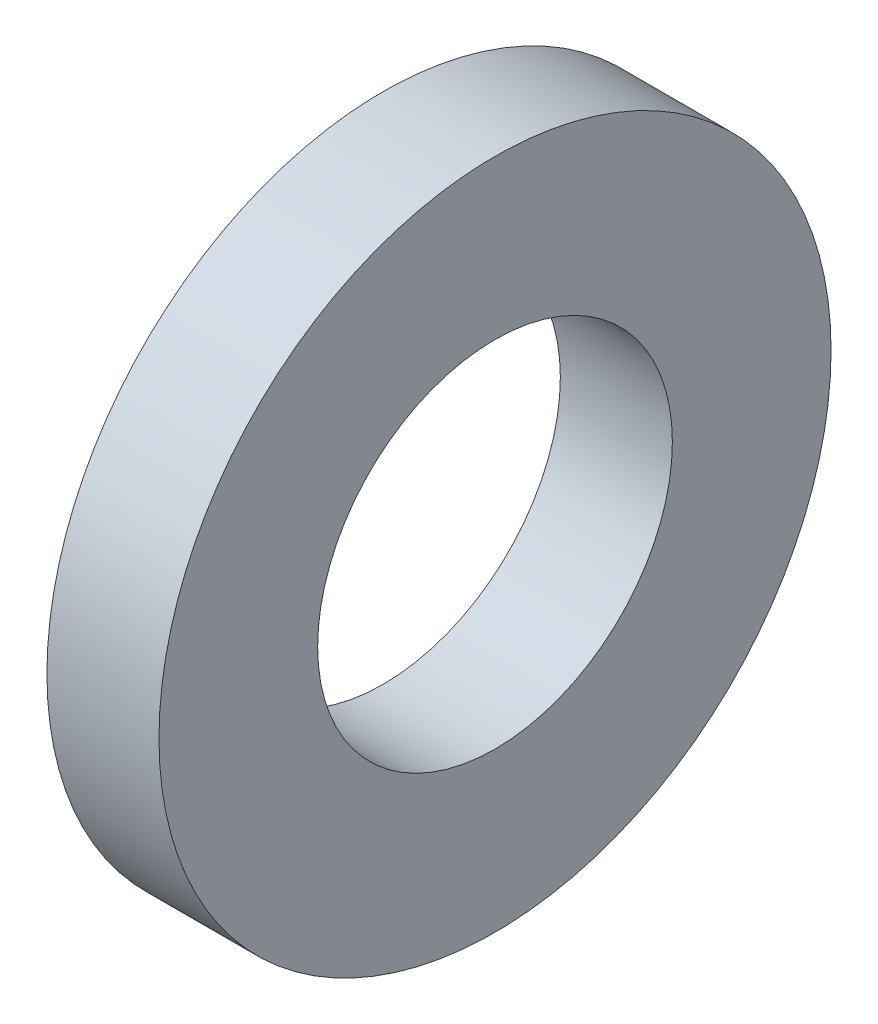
ISO-10303-21;
HEADER;
FILE_DESCRIPTION(('STEP AP214'),'2;1');
FILE_NAME('part.step','',(''),(''),'','','');
FILE_SCHEMA(('AUTOMOTIVE_DESIGN { 1 0 10303 214 1 1 1 1 }'));
ENDSEC;
DATA;
#1=APPLICATION_CONTEXT('core data for automotive mechanical design processes');
#2=APPLICATION_PROTOCOL_DEFINITION('international standard','automotive_design',2000,#1);
#3=PRODUCT_CONTEXT('',#1,'mechanical');
#4=PRODUCT('Part','Part','',(#3));
#5=PRODUCT_RELATED_PRODUCT_CATEGORY('part','',(#4));
#6=PRODUCT_DEFINITION_FORMATION('','',#4);
#7=PRODUCT_DEFINITION_CONTEXT('part definition',#1,'design');
#8=PRODUCT_DEFINITION('design','',#6,#7);
#9=PRODUCT_DEFINITION_SHAPE('','',#8);
#10=(LENGTH_UNIT() NAMED_UNIT(*) SI_UNIT(.MILLI.,.METRE.));
#11=(NAMED_UNIT(*) PLANE_ANGLE_UNIT() SI_UNIT($,.RADIAN.));
#12=(NAMED_UNIT(*) SI_UNIT($,.STERADIAN.) SOLID_ANGLE_UNIT());
#13=UNCERTAINTY_MEASURE_WITH_UNIT(LENGTH_MEASURE(1.E-05),#10,'distance_accuracy_value','');
#14=(GEOMETRIC_REPRESENTATION_CONTEXT(3) GLOBAL_UNCERTAINTY_ASSIGNED_CONTEXT((#13)) GLOBAL_UNIT_ASSIGNED_CONTEXT((#10,
#11,#12)) REPRESENTATION_CONTEXT('',''));
#15=CARTESIAN_POINT('',(0.,0.,0.));
#16=DIRECTION('',(0.,0.,1.));
#17=DIRECTION('',(1.,0.,0.));
#18=AXIS2_PLACEMENT_3D('',#15,#16,#17);
#19=CARTESIAN_POINT('',(0.,120.65,0.));
#20=DIRECTION('',(1.,0.,0.));
#21=DIRECTION('',(0.,0.,-1.));
#22=AXIS2_PLACEMENT_3D('',#19,#20,#21);
#23=PLANE('',#22);
#24=CARTESIAN_POINT('',(0.,146.665875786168,-60.7509948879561));
#25=DIRECTION('',(-1.,0.,0.));
#26=DIRECTION('',(0.,0.707106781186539,0.707106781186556));
#27=AXIS2_PLACEMENT_3D('',#24,#25,#26);
#28=CIRCLE('',#27,12.7);
#29=CARTESIAN_POINT('',(0.,155.646131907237,-51.7707387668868));
#30=VERTEX_POINT('',#29);
#31=EDGE_CURVE('E88',#30,#30,#28,.T.);
#32=ORIENTED_EDGE('',*,*,#31,.F.);
#33=EDGE_LOOP('',(#32));
#34=FACE_BOUND('',#33,.T.);
#35=CARTESIAN_POINT('',(0.,60.7509948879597,-146.665875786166));
#36=DIRECTION('',(-1.,0.,0.));
#37=DIRECTION('',(0.,1.,0.));
#38=AXIS2_PLACEMENT_3D('',#35,#36,#37);
#39=CIRCLE('',#38,12.7);
#40=CARTESIAN_POINT('',(0.,73.4509948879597,-146.665875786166));
#41=VERTEX_POINT('',#40);
#42=EDGE_CURVE('E82',#41,#41,#39,.T.);
#43=ORIENTED_EDGE('',*,*,#42,.F.);
#44=EDGE_LOOP('',(#43));
#45=FACE_BOUND('',#44,.T.);
#46=CARTESIAN_POINT('',(0.,-60.7509948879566,-146.665875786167));
#47=DIRECTION('',(-1.,0.,0.));
#48=DIRECTION('',(0.,0.707106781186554,-0.707106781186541));
#49=AXIS2_PLACEMENT_3D('',#46,#47,#48);
#50=CIRCLE('',#49,12.7);
#51=CARTESIAN_POINT('',(0.,-51.7707387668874,-155.646131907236));
#52=VERTEX_POINT('',#51);
#53=EDGE_CURVE('E76',#52,#52,#50,.T.);
#54=ORIENTED_EDGE('',*,*,#53,.F.);
#55=EDGE_LOOP('',(#54));
#56=FACE_BOUND('',#55,.T.);
#57=CARTESIAN_POINT('',(0.,-146.665875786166,-60.7509948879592));
#58=DIRECTION('',(-1.,0.,0.));
#59=DIRECTION('',(0.,0.,-1.));
#60=AXIS2_PLACEMENT_3D('',#57,#58,#59);
#61=CIRCLE('',#60,12.7);
#62=CARTESIAN_POINT('',(0.,-146.665875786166,-73.4509948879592));
#63=VERTEX_POINT('',#62);
#64=EDGE_CURVE('E70',#63,#63,#61,.T.);
#65=ORIENTED_EDGE('',*,*,#64,.F.);
#66=EDGE_LOOP('',(#65));
#67=FACE_BOUND('',#66,.T.);
#68=CARTESIAN_POINT('',(0.,-146.665875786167,60.7509948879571));
#69=DIRECTION('',(-1.,0.,0.));
#70=DIRECTION('',(0.,-0.707106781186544,-0.707106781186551));
#71=AXIS2_PLACEMENT_3D('',#68,#69,#70);
#72=CIRCLE('',#71,12.7);
#73=CARTESIAN_POINT('',(0.,-155.646131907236,51.7707387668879));
#74=VERTEX_POINT('',#73);
#75=EDGE_CURVE('E64',#74,#74,#72,.T.);
#76=ORIENTED_EDGE('',*,*,#75,.F.);
#77=EDGE_LOOP('',(#76));
#78=FACE_BOUND('',#77,.T.);
#79=CARTESIAN_POINT('',(0.,-60.7509948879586,146.665875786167));
#80=DIRECTION('',(-1.,0.,0.));
#81=DIRECTION('',(0.,-1.,0.));
#82=AXIS2_PLACEMENT_3D('',#79,#80,#81);
#83=CIRCLE('',#82,12.7);
#84=CARTESIAN_POINT('',(0.,-73.4509948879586,146.665875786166));
#85=VERTEX_POINT('',#84);
#86=EDGE_CURVE('E58',#85,#85,#83,.T.);
#87=ORIENTED_EDGE('',*,*,#86,.F.);
#88=EDGE_LOOP('',(#87));
#89=FACE_BOUND('',#88,.T.);
#90=CARTESIAN_POINT('',(0.,60.7509948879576,146.665875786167));
#91=DIRECTION('',(-1.,0.,0.));
#92=DIRECTION('',(0.,-0.707106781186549,0.707106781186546));
#93=AXIS2_PLACEMENT_3D('',#90,#91,#92);
#94=CIRCLE('',#93,12.7);
#95=CARTESIAN_POINT('',(0.,51.7707387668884,155.646131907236));
#96=VERTEX_POINT('',#95);
#97=EDGE_CURVE('E52',#96,#96,#94,.T.);
#98=ORIENTED_EDGE('',*,*,#97,.F.);
#99=EDGE_LOOP('',(#98));
#100=FACE_BOUND('',#99,.T.);
#101=CARTESIAN_POINT('',(0.,146.665875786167,60.7509948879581));
#102=DIRECTION('',(-1.,0.,0.));
#103=DIRECTION('',(0.,0.,1.));
#104=AXIS2_PLACEMENT_3D('',#101,#102,#103);
#105=CIRCLE('',#104,12.7);
#106=CARTESIAN_POINT('',(0.,146.665875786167,73.4509948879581));
#107=VERTEX_POINT('',#106);
#108=EDGE_CURVE('E46',#107,#107,#105,.T.);
#109=ORIENTED_EDGE('',*,*,#108,.F.);
#110=EDGE_LOOP('',(#109));
#111=FACE_BOUND('',#110,.T.);
#112=CARTESIAN_POINT('',(0.,0.,0.));
#113=DIRECTION('',(-1.,0.,0.));
#114=DIRECTION('',(0.,0.,1.));
#115=AXIS2_PLACEMENT_3D('',#112,#113,#114);
#116=CIRCLE('',#115,120.65);
#117=CARTESIAN_POINT('',(0.,0.,120.65));
#118=VERTEX_POINT('',#117);
#119=EDGE_CURVE('E38',#118,#118,#116,.T.);
#120=ORIENTED_EDGE('',*,*,#119,.F.);
#121=EDGE_LOOP('',(#120));
#122=FACE_BOUND('',#121,.T.);
#123=CARTESIAN_POINT('',(0.,0.,0.));
#124=DIRECTION('',(-1.,0.,0.));
#125=DIRECTION('',(0.,0.,1.));
#126=AXIS2_PLACEMENT_3D('',#123,#124,#125);
#127=CIRCLE('',#126,228.6);
#128=CARTESIAN_POINT('',(0.,0.,228.6));
#129=VERTEX_POINT('',#128);
#130=EDGE_CURVE('E10',#129,#129,#127,.T.);
#131=ORIENTED_EDGE('',*,*,#130,.T.);
#132=EDGE_LOOP('',(#131));
#133=FACE_BOUND('',#132,.T.);
#134=ADVANCED_FACE('F24',(#34,#45,#56,#67,#78,#89,#100,#111,#122,#133),#23,.F.);
#135=CARTESIAN_POINT('',(0.,0.,0.));
#136=DIRECTION('',(-1.,0.,0.));
#137=DIRECTION('',(0.,0.,1.));
#138=AXIS2_PLACEMENT_3D('',#135,#136,#137);
#139=CYLINDRICAL_SURFACE('',#138,228.6);
#140=ORIENTED_EDGE('',*,*,#130,.F.);
#141=EDGE_LOOP('',(#140));
#142=FACE_BOUND('',#141,.T.);
#143=CARTESIAN_POINT('',(76.2,0.,0.));
#144=DIRECTION('',(-1.,0.,0.));
#145=DIRECTION('',(0.,0.,1.));
#146=AXIS2_PLACEMENT_3D('',#143,#144,#145);
#147=CIRCLE('',#146,228.6);
#148=CARTESIAN_POINT('',(76.2,0.,228.6));
#149=VERTEX_POINT('',#148);
#150=EDGE_CURVE('E30',#149,#149,#147,.T.);
#151=ORIENTED_EDGE('',*,*,#150,.T.);
#152=EDGE_LOOP('',(#151));
#153=FACE_BOUND('',#152,.T.);
#154=ADVANCED_FACE('F96',(#142,#153),#139,.T.);
#155=CARTESIAN_POINT('',(76.2,228.6,0.));
#156=DIRECTION('',(-1.,0.,0.));
#157=DIRECTION('',(0.,0.,1.));
#158=AXIS2_PLACEMENT_3D('',#155,#156,#157);
#159=PLANE('',#158);
#160=ORIENTED_EDGE('',*,*,#150,.F.);
#161=EDGE_LOOP('',(#160));
#162=FACE_BOUND('',#161,.T.);
#163=CARTESIAN_POINT('',(76.2,0.,0.));
#164=DIRECTION('',(-1.,0.,0.));
#165=DIRECTION('',(0.,0.,1.));
#166=AXIS2_PLACEMENT_3D('',#163,#164,#165);
#167=CIRCLE('',#166,120.65);
#168=CARTESIAN_POINT('',(76.2,0.,120.65));
#169=VERTEX_POINT('',#168);
#170=EDGE_CURVE('E34',#169,#169,#167,.T.);
#171=ORIENTED_EDGE('',*,*,#170,.T.);
#172=EDGE_LOOP('',(#171));
#173=FACE_BOUND('',#172,.T.);
#174=ADVANCED_FACE('F116',(#162,#173),#159,.F.);
#175=CARTESIAN_POINT('',(0.,0.,0.));
#176=DIRECTION('',(-1.,0.,0.));
#177=DIRECTION('',(0.,0.,1.));
#178=AXIS2_PLACEMENT_3D('',#175,#176,#177);
#179=CYLINDRICAL_SURFACE('',#178,120.65);
#180=ORIENTED_EDGE('',*,*,#170,.F.);
#181=EDGE_LOOP('',(#180));
#182=FACE_BOUND('',#181,.T.);
#183=ORIENTED_EDGE('',*,*,#119,.T.);
#184=EDGE_LOOP('',(#183));
#185=FACE_BOUND('',#184,.T.);
#186=ADVANCED_FACE('F113',(#182,#185),#179,.F.);
#187=CARTESIAN_POINT('',(30.,146.665875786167,60.7509948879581));
#188=DIRECTION('',(-1.,0.,0.));
#189=DIRECTION('',(0.,0.,1.));
#190=AXIS2_PLACEMENT_3D('',#187,#188,#189);
#191=CYLINDRICAL_SURFACE('',#190,12.7);
#192=CARTESIAN_POINT('',(30.,146.665875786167,60.7509948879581));
#193=DIRECTION('',(-1.,0.,0.));
#194=DIRECTION('',(0.,0.,1.));
#195=AXIS2_PLACEMENT_3D('',#192,#193,#194);
#196=CIRCLE('',#195,12.7);
#197=CARTESIAN_POINT('',(30.,146.665875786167,73.4509948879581));
#198=VERTEX_POINT('',#197);
#199=EDGE_CURVE('E43',#198,#198,#196,.T.);
#200=ORIENTED_EDGE('',*,*,#199,.F.);
#201=EDGE_LOOP('',(#200));
#202=FACE_BOUND('',#201,.T.);
#203=ORIENTED_EDGE('',*,*,#108,.T.);
#204=EDGE_LOOP('',(#203));
#205=FACE_BOUND('',#204,.T.);
#206=ADVANCED_FACE('F115',(#202,#205),#191,.F.);
#207=CARTESIAN_POINT('',(30.,146.665875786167,60.7509948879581));
#208=DIRECTION('',(-1.,0.,0.));
#209=DIRECTION('',(0.,0.,1.));
#210=AXIS2_PLACEMENT_3D('',#207,#208,#209);
#211=PLANE('',#210);
#212=ORIENTED_EDGE('',*,*,#199,.T.);
#213=EDGE_LOOP('',(#212));
#214=FACE_BOUND('',#213,.T.);
#215=ADVANCED_FACE('F123',(#214),#211,.T.);
#216=CARTESIAN_POINT('',(30.,60.7509948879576,146.665875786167));
#217=DIRECTION('',(-1.,0.,0.));
#218=DIRECTION('',(0.,0.,1.));
#219=AXIS2_PLACEMENT_3D('',#216,#217,#218);
#220=CYLINDRICAL_SURFACE('',#219,12.7);
#221=CARTESIAN_POINT('',(30.,60.7509948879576,146.665875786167));
#222=DIRECTION('',(-1.,0.,0.));
#223=DIRECTION('',(0.,-0.707106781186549,0.707106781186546));
#224=AXIS2_PLACEMENT_3D('',#221,#222,#223);
#225=CIRCLE('',#224,12.7);
#226=CARTESIAN_POINT('',(30.,51.7707387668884,155.646131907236));
#227=VERTEX_POINT('',#226);
#228=EDGE_CURVE('E49',#227,#227,#225,.T.);
#229=ORIENTED_EDGE('',*,*,#228,.F.);
#230=EDGE_LOOP('',(#229));
#231=FACE_BOUND('',#230,.T.);
#232=ORIENTED_EDGE('',*,*,#97,.T.);
#233=EDGE_LOOP('',(#232));
#234=FACE_BOUND('',#233,.T.);
#235=ADVANCED_FACE('F152',(#231,#234),#220,.F.);
#236=CARTESIAN_POINT('',(30.,60.7509948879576,146.665875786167));
#237=DIRECTION('',(-1.,0.,0.));
#238=DIRECTION('',(0.,-0.707106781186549,0.707106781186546));
#239=AXIS2_PLACEMENT_3D('',#236,#237,#238);
#240=PLANE('',#239);
#241=ORIENTED_EDGE('',*,*,#228,.T.);
#242=EDGE_LOOP('',(#241));
#243=FACE_BOUND('',#242,.T.);
#244=ADVANCED_FACE('F159',(#243),#240,.T.);
#245=CARTESIAN_POINT('',(30.,-60.7509948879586,146.665875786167));
#246=DIRECTION('',(-1.,0.,0.));
#247=DIRECTION('',(0.,0.,1.));
#248=AXIS2_PLACEMENT_3D('',#245,#246,#247);
#249=CYLINDRICAL_SURFACE('',#248,12.7);
#250=CARTESIAN_POINT('',(30.,-60.7509948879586,146.665875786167));
#251=DIRECTION('',(-1.,0.,0.));
#252=DIRECTION('',(0.,-1.,0.));
#253=AXIS2_PLACEMENT_3D('',#250,#251,#252);
#254=CIRCLE('',#253,12.7);
#255=CARTESIAN_POINT('',(30.,-73.4509948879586,146.665875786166));
#256=VERTEX_POINT('',#255);
#257=EDGE_CURVE('E55',#256,#256,#254,.T.);
#258=ORIENTED_EDGE('',*,*,#257,.F.);
#259=EDGE_LOOP('',(#258));
#260=FACE_BOUND('',#259,.T.);
#261=ORIENTED_EDGE('',*,*,#86,.T.);
#262=EDGE_LOOP('',(#261));
#263=FACE_BOUND('',#262,.T.);
#264=ADVANCED_FACE('F167',(#260,#263),#249,.F.);
#265=CARTESIAN_POINT('',(30.,-60.7509948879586,146.665875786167));
#266=DIRECTION('',(-1.,0.,0.));
#267=DIRECTION('',(0.,-1.,0.));
#268=AXIS2_PLACEMENT_3D('',#265,#266,#267);
#269=PLANE('',#268);
#270=ORIENTED_EDGE('',*,*,#257,.T.);
#271=EDGE_LOOP('',(#270));
#272=FACE_BOUND('',#271,.T.);
#273=ADVANCED_FACE('F175',(#272),#269,.T.);
#274=CARTESIAN_POINT('',(30.,-146.665875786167,60.7509948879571));
#275=DIRECTION('',(-1.,0.,0.));
#276=DIRECTION('',(0.,0.,1.));
#277=AXIS2_PLACEMENT_3D('',#274,#275,#276);
#278=CYLINDRICAL_SURFACE('',#277,12.7);
#279=CARTESIAN_POINT('',(30.,-146.665875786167,60.7509948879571));
#280=DIRECTION('',(-1.,0.,0.));
#281=DIRECTION('',(0.,-0.707106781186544,-0.707106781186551));
#282=AXIS2_PLACEMENT_3D('',#279,#280,#281);
#283=CIRCLE('',#282,12.7);
#284=CARTESIAN_POINT('',(30.,-155.646131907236,51.7707387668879));
#285=VERTEX_POINT('',#284);
#286=EDGE_CURVE('E61',#285,#285,#283,.T.);
#287=ORIENTED_EDGE('',*,*,#286,.F.);
#288=EDGE_LOOP('',(#287));
#289=FACE_BOUND('',#288,.T.);
#290=ORIENTED_EDGE('',*,*,#75,.T.);
#291=EDGE_LOOP('',(#290));
#292=FACE_BOUND('',#291,.T.);
#293=ADVANCED_FACE('F183',(#289,#292),#278,.F.);
#294=CARTESIAN_POINT('',(30.,-146.665875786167,60.7509948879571));
#295=DIRECTION('',(-1.,0.,0.));
#296=DIRECTION('',(0.,-0.707106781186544,-0.707106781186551));
#297=AXIS2_PLACEMENT_3D('',#294,#295,#296);
#298=PLANE('',#297);
#299=ORIENTED_EDGE('',*,*,#286,.T.);
#300=EDGE_LOOP('',(#299));
#301=FACE_BOUND('',#300,.T.);
#302=ADVANCED_FACE('F191',(#301),#298,.T.);
#303=CARTESIAN_POINT('',(30.,-146.665875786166,-60.7509948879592));
#304=DIRECTION('',(-1.,0.,0.));
#305=DIRECTION('',(0.,0.,1.));
#306=AXIS2_PLACEMENT_3D('',#303,#304,#305);
#307=CYLINDRICAL_SURFACE('',#306,12.7);
#308=CARTESIAN_POINT('',(30.,-146.665875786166,-60.7509948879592));
#309=DIRECTION('',(-1.,0.,0.));
#310=DIRECTION('',(0.,0.,-1.));
#311=AXIS2_PLACEMENT_3D('',#308,#309,#310);
#312=CIRCLE('',#311,12.7);
#313=CARTESIAN_POINT('',(30.,-146.665875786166,-73.4509948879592));
#314=VERTEX_POINT('',#313);
#315=EDGE_CURVE('E67',#314,#314,#312,.T.);
#316=ORIENTED_EDGE('',*,*,#315,.F.);
#317=EDGE_LOOP('',(#316));
#318=FACE_BOUND('',#317,.T.);
#319=ORIENTED_EDGE('',*,*,#64,.T.);
#320=EDGE_LOOP('',(#319));
#321=FACE_BOUND('',#320,.T.);
#322=ADVANCED_FACE('F199',(#318,#321),#307,.F.);
#323=CARTESIAN_POINT('',(30.,-146.665875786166,-60.7509948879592));
#324=DIRECTION('',(-1.,0.,0.));
#325=DIRECTION('',(0.,0.,-1.));
#326=AXIS2_PLACEMENT_3D('',#323,#324,#325);
#327=PLANE('',#326);
#328=ORIENTED_EDGE('',*,*,#315,.T.);
#329=EDGE_LOOP('',(#328));
#330=FACE_BOUND('',#329,.T.);
#331=ADVANCED_FACE('F207',(#330),#327,.T.);
#332=CARTESIAN_POINT('',(30.,-60.7509948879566,-146.665875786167));
#333=DIRECTION('',(-1.,0.,0.));
#334=DIRECTION('',(0.,0.,1.));
#335=AXIS2_PLACEMENT_3D('',#332,#333,#334);
#336=CYLINDRICAL_SURFACE('',#335,12.7);
#337=CARTESIAN_POINT('',(30.,-60.7509948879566,-146.665875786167));
#338=DIRECTION('',(-1.,0.,0.));
#339=DIRECTION('',(0.,0.707106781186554,-0.707106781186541));
#340=AXIS2_PLACEMENT_3D('',#337,#338,#339);
#341=CIRCLE('',#340,12.7);
#342=CARTESIAN_POINT('',(30.,-51.7707387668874,-155.646131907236));
#343=VERTEX_POINT('',#342);
#344=EDGE_CURVE('E73',#343,#343,#341,.T.);
#345=ORIENTED_EDGE('',*,*,#344,.F.);
#346=EDGE_LOOP('',(#345));
#347=FACE_BOUND('',#346,.T.);
#348=ORIENTED_EDGE('',*,*,#53,.T.);
#349=EDGE_LOOP('',(#348));
#350=FACE_BOUND('',#349,.T.);
#351=ADVANCED_FACE('F215',(#347,#350),#336,.F.);
#352=CARTESIAN_POINT('',(30.,-60.7509948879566,-146.665875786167));
#353=DIRECTION('',(-1.,0.,0.));
#354=DIRECTION('',(0.,0.707106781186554,-0.707106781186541));
#355=AXIS2_PLACEMENT_3D('',#352,#353,#354);
#356=PLANE('',#355);
#357=ORIENTED_EDGE('',*,*,#344,.T.);
#358=EDGE_LOOP('',(#357));
#359=FACE_BOUND('',#358,.T.);
#360=ADVANCED_FACE('F223',(#359),#356,.T.);
#361=CARTESIAN_POINT('',(30.,60.7509948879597,-146.665875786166));
#362=DIRECTION('',(-1.,0.,0.));
#363=DIRECTION('',(0.,0.,1.));
#364=AXIS2_PLACEMENT_3D('',#361,#362,#363);
#365=CYLINDRICAL_SURFACE('',#364,12.7);
#366=CARTESIAN_POINT('',(30.,60.7509948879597,-146.665875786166));
#367=DIRECTION('',(-1.,0.,0.));
#368=DIRECTION('',(0.,1.,0.));
#369=AXIS2_PLACEMENT_3D('',#366,#367,#368);
#370=CIRCLE('',#369,12.7);
#371=CARTESIAN_POINT('',(30.,73.4509948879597,-146.665875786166));
#372=VERTEX_POINT('',#371);
#373=EDGE_CURVE('E79',#372,#372,#370,.T.);
#374=ORIENTED_EDGE('',*,*,#373,.F.);
#375=EDGE_LOOP('',(#374));
#376=FACE_BOUND('',#375,.T.);
#377=ORIENTED_EDGE('',*,*,#42,.T.);
#378=EDGE_LOOP('',(#377));
#379=FACE_BOUND('',#378,.T.);
#380=ADVANCED_FACE('F231',(#376,#379),#365,.F.);
#381=CARTESIAN_POINT('',(30.,60.7509948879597,-146.665875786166));
#382=DIRECTION('',(-1.,0.,0.));
#383=DIRECTION('',(0.,1.,0.));
#384=AXIS2_PLACEMENT_3D('',#381,#382,#383);
#385=PLANE('',#384);
#386=ORIENTED_EDGE('',*,*,#373,.T.);
#387=EDGE_LOOP('',(#386));
#388=FACE_BOUND('',#387,.T.);
#389=ADVANCED_FACE('F239',(#388),#385,.T.);
#390=CARTESIAN_POINT('',(30.,146.665875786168,-60.7509948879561));
#391=DIRECTION('',(-1.,0.,0.));
#392=DIRECTION('',(0.,0.,1.));
#393=AXIS2_PLACEMENT_3D('',#390,#391,#392);
#394=CYLINDRICAL_SURFACE('',#393,12.7);
#395=CARTESIAN_POINT('',(30.,146.665875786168,-60.7509948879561));
#396=DIRECTION('',(-1.,0.,0.));
#397=DIRECTION('',(0.,0.707106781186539,0.707106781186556));
#398=AXIS2_PLACEMENT_3D('',#395,#396,#397);
#399=CIRCLE('',#398,12.7);
#400=CARTESIAN_POINT('',(30.,155.646131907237,-51.7707387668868));
#401=VERTEX_POINT('',#400);
#402=EDGE_CURVE('E85',#401,#401,#399,.T.);
#403=ORIENTED_EDGE('',*,*,#402,.F.);
#404=EDGE_LOOP('',(#403));
#405=FACE_BOUND('',#404,.T.);
#406=ORIENTED_EDGE('',*,*,#31,.T.);
#407=EDGE_LOOP('',(#406));
#408=FACE_BOUND('',#407,.T.);
#409=ADVANCED_FACE('F92',(#405,#408),#394,.F.);
#410=CARTESIAN_POINT('',(30.,146.665875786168,-60.7509948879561));
#411=DIRECTION('',(-1.,0.,0.));
#412=DIRECTION('',(0.,0.707106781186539,0.707106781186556));
#413=AXIS2_PLACEMENT_3D('',#410,#411,#412);
#414=PLANE('',#413);
#415=ORIENTED_EDGE('',*,*,#402,.T.);
#416=EDGE_LOOP('',(#415));
#417=FACE_BOUND('',#416,.T.);
#418=ADVANCED_FACE('F254',(#417),#414,.T.);
#419=CLOSED_SHELL('',(#134,#154,#174,#186,#206,#215,#235,#244,#264,#273,#293,#302,#322,#331,
#351,#360,#380,#389,#409,#418));
#420=MANIFOLD_SOLID_BREP('B2',#419);
#421=ADVANCED_BREP_SHAPE_REPRESENTATION('',(#18,#420),#14);
#422=SHAPE_DEFINITION_REPRESENTATION(#9,#421);
ENDSEC;
END-ISO-10303-21;
